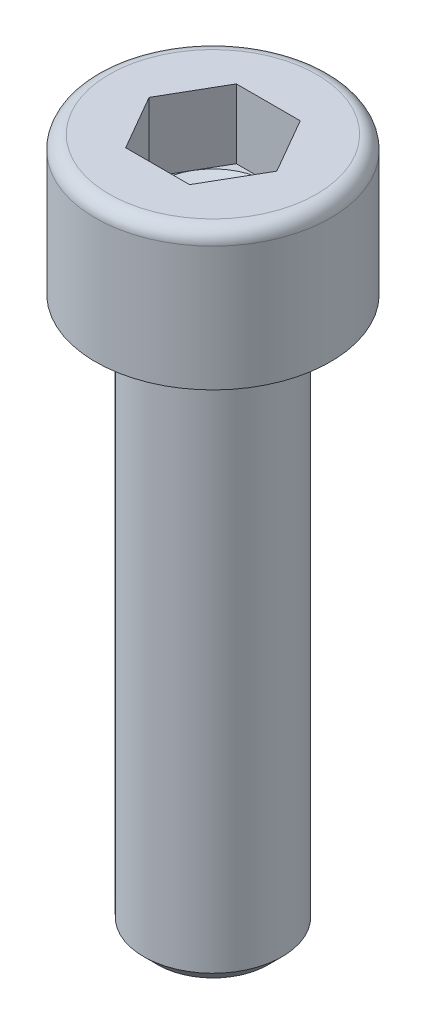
from build123d import *

# Parameters (mm, degrees)
ENL_V_MAT_EXTRU_1_DEPTH = 2.5


with BuildPart() as part:
    # E_corps → corps (revolve)
    with BuildSketch(Plane.XY, mode=Mode.PRIVATE) as corps_sk:
        with BuildLine():
            Line((2.5, -5), (4.25, -5))
            Line((4.25, -5), (4.25, -0.5))
            ThreePointArc((4.25, -0.5), (4.103553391, -0.146446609), (3.75, 0))
            Line((3.75, 0), (0, 0))
            Line((0, 0), (0, -25))
            Line((0, -25), (2, -25))
            Line((2, -25), (2.5, -24.5))
            Line((2.5, -24.5), (2.5, -5))
        make_face()
    revolve(corps_sk.sketch.rotate(Axis((0, 65.117292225, 0), (0, -1, 0)), 180), axis=Axis((0, 65.117292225, 0), (0, -1, 0)))

    # Hexagone1 → Enl_v. mat.-Extru.1 (cut)
    with BuildSketch(Plane(origin=(6.82301688, 0, -4.397067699), x_dir=(-1, 0, 0), z_dir=(0, 1, 0))):
        Polygon((5.668316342, 6.397067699), (7.977717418, 6.397067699), (9.132417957, 4.397067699), (7.977717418, 2.397067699), (5.668316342, 2.397067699), (4.513615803, 4.397067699), align=None)
    extrude(amount=-ENL_V_MAT_EXTRU_1_DEPTH, mode=Mode.SUBTRACT)

    # Enl_v. mat.-Extru.2 cone 1 section (on through the dimple's axis) → Enl_v. mat.-Extru.2 (revolve, cut)
    with BuildSketch(Plane(origin=(0, -2.5, 0), x_dir=(0, 0, 1), z_dir=(1, 0, 0))):
        Polygon((0, 0), (2, 0), (0, 0.727940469), align=None)
    revolve(axis=Axis((0, -2.5, 0), (0, -1, 0)), mode=Mode.SUBTRACT)


solid = part.part
